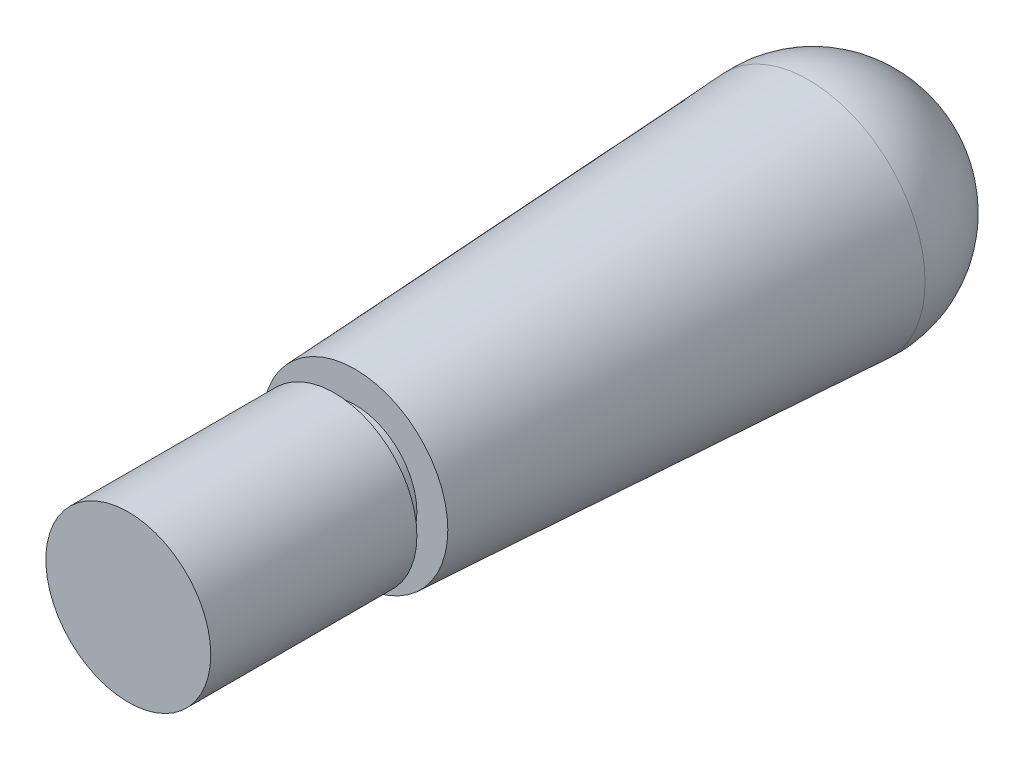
from build123d import *


with BuildPart() as part:
    # Sketch1 → Revolve1 (revolve)
    with BuildSketch(Plane(origin=(0, 0, 0), x_dir=(0, 0, -1), z_dir=(1, 0, 0)), mode=Mode.PRIVATE) as revolve1_sk:
        with BuildLine():
            Line((0, 101.6), (254, 101.6))
            Line((254, 101.6), (254, 76.2))
            Line((254, 76.2), (279.4, 76.2))
            Line((279.4, 76.2), (279.4, 114.3))
            Line((279.4, 114.3), (838.2, 143.585467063))
            ThreePointArc((838.2, 143.585467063), (943.143031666, 103.997596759), (985.151831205, 0))
            Line((985.151831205, 0), (0, 0))
            Line((0, 0), (0, 101.6))
        make_face()
    revolve(revolve1_sk.sketch.rotate(Axis((0, 0, 0), (0, 0, -1)), 90), axis=Axis((0, 0, 0), (0, 0, -1)))


solid = part.part
